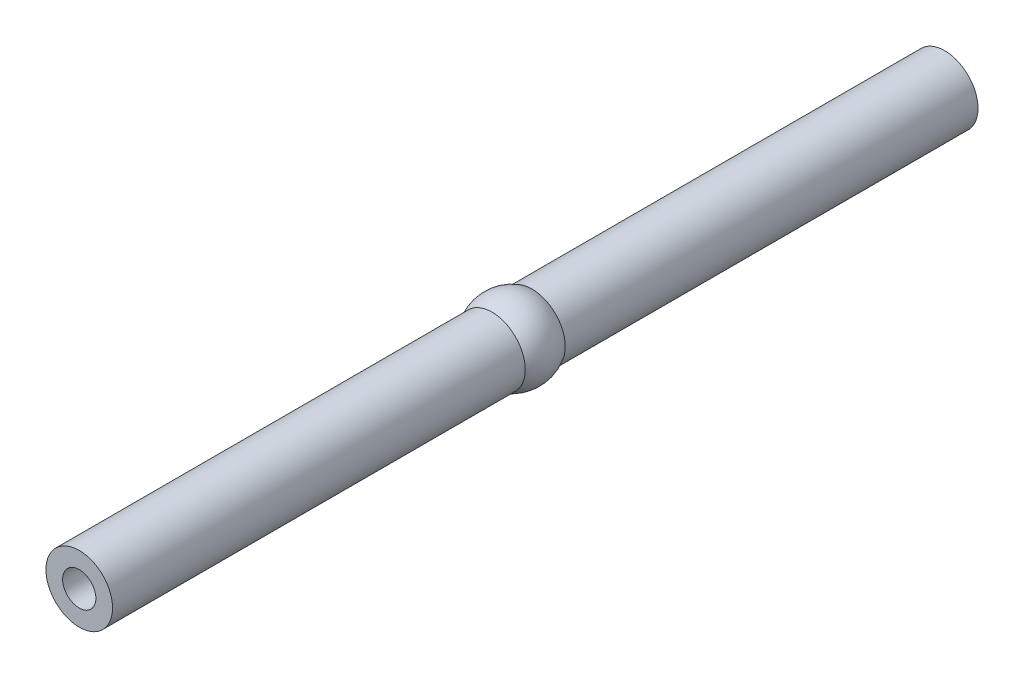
ISO-10303-21;
HEADER;
FILE_DESCRIPTION(('STEP AP214'),'2;1');
FILE_NAME('part.step','',(''),(''),'','','');
FILE_SCHEMA(('AUTOMOTIVE_DESIGN { 1 0 10303 214 1 1 1 1 }'));
ENDSEC;
DATA;
#1=APPLICATION_CONTEXT('core data for automotive mechanical design processes');
#2=APPLICATION_PROTOCOL_DEFINITION('international standard','automotive_design',2000,#1);
#3=PRODUCT_CONTEXT('',#1,'mechanical');
#4=PRODUCT('Part','Part','',(#3));
#5=PRODUCT_RELATED_PRODUCT_CATEGORY('part','',(#4));
#6=PRODUCT_DEFINITION_FORMATION('','',#4);
#7=PRODUCT_DEFINITION_CONTEXT('part definition',#1,'design');
#8=PRODUCT_DEFINITION('design','',#6,#7);
#9=PRODUCT_DEFINITION_SHAPE('','',#8);
#10=(LENGTH_UNIT() NAMED_UNIT(*) SI_UNIT(.MILLI.,.METRE.));
#11=(NAMED_UNIT(*) PLANE_ANGLE_UNIT() SI_UNIT($,.RADIAN.));
#12=(NAMED_UNIT(*) SI_UNIT($,.STERADIAN.) SOLID_ANGLE_UNIT());
#13=UNCERTAINTY_MEASURE_WITH_UNIT(LENGTH_MEASURE(1.E-05),#10,'distance_accuracy_value','');
#14=(GEOMETRIC_REPRESENTATION_CONTEXT(3) GLOBAL_UNCERTAINTY_ASSIGNED_CONTEXT((#13)) GLOBAL_UNIT_ASSIGNED_CONTEXT((#10,
#11,#12)) REPRESENTATION_CONTEXT('',''));
#15=CARTESIAN_POINT('',(0.,0.,0.));
#16=DIRECTION('',(0.,0.,1.));
#17=DIRECTION('',(1.,0.,0.));
#18=AXIS2_PLACEMENT_3D('',#15,#16,#17);
#19=CARTESIAN_POINT('',(0.,0.,39.));
#20=DIRECTION('',(0.,0.,-1.));
#21=DIRECTION('',(-1.,0.,0.));
#22=AXIS2_PLACEMENT_3D('',#19,#20,#21);
#23=CYLINDRICAL_SURFACE('',#22,3.);
#24=CARTESIAN_POINT('',(0.,0.,-39.));
#25=DIRECTION('',(0.,0.,1.));
#26=DIRECTION('',(1.,0.,0.));
#27=AXIS2_PLACEMENT_3D('',#24,#25,#26);
#28=CIRCLE('',#27,3.);
#29=CARTESIAN_POINT('',(3.,0.,-39.));
#30=VERTEX_POINT('',#29);
#31=EDGE_CURVE('E45',#30,#30,#28,.T.);
#32=ORIENTED_EDGE('',*,*,#31,.T.);
#33=EDGE_LOOP('',(#32));
#34=FACE_BOUND('',#33,.T.);
#35=CARTESIAN_POINT('',(0.,0.,-1.802775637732));
#36=DIRECTION('',(0.,0.,1.));
#37=DIRECTION('',(1.,0.,0.));
#38=AXIS2_PLACEMENT_3D('',#35,#36,#37);
#39=CIRCLE('',#38,3.);
#40=CARTESIAN_POINT('',(3.,0.,-1.802775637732));
#41=VERTEX_POINT('',#40);
#42=EDGE_CURVE('E10',#41,#41,#39,.T.);
#43=ORIENTED_EDGE('',*,*,#42,.F.);
#44=EDGE_LOOP('',(#43));
#45=FACE_BOUND('',#44,.T.);
#46=ADVANCED_FACE('F31',(#34,#45),#23,.T.);
#47=CARTESIAN_POINT('',(0.,0.,-39.));
#48=DIRECTION('',(0.,0.,1.));
#49=DIRECTION('',(1.,0.,0.));
#50=AXIS2_PLACEMENT_3D('',#47,#48,#49);
#51=PLANE('',#50);
#52=ORIENTED_EDGE('',*,*,#31,.F.);
#53=EDGE_LOOP('',(#52));
#54=FACE_BOUND('',#53,.T.);
#55=CARTESIAN_POINT('',(0.,0.,-39.));
#56=DIRECTION('',(0.,0.,1.));
#57=DIRECTION('',(1.,0.,0.));
#58=AXIS2_PLACEMENT_3D('',#55,#56,#57);
#59=CIRCLE('',#58,1.5);
#60=CARTESIAN_POINT('',(1.5,0.,-39.));
#61=VERTEX_POINT('',#60);
#62=EDGE_CURVE('E59',#61,#61,#59,.T.);
#63=ORIENTED_EDGE('',*,*,#62,.T.);
#64=EDGE_LOOP('',(#63));
#65=FACE_BOUND('',#64,.T.);
#66=ADVANCED_FACE('F63',(#54,#65),#51,.F.);
#67=CARTESIAN_POINT('',(0.,0.,-29.));
#68=DIRECTION('',(0.,0.,-1.));
#69=DIRECTION('',(-1.,0.,0.));
#70=AXIS2_PLACEMENT_3D('',#67,#68,#69);
#71=CYLINDRICAL_SURFACE('',#70,1.5);
#72=CARTESIAN_POINT('',(0.,0.,-29.));
#73=DIRECTION('',(0.,0.,1.));
#74=DIRECTION('',(1.,0.,0.));
#75=AXIS2_PLACEMENT_3D('',#72,#73,#74);
#76=CIRCLE('',#75,1.5);
#77=CARTESIAN_POINT('',(1.5,0.,-29.));
#78=VERTEX_POINT('',#77);
#79=EDGE_CURVE('E56',#78,#78,#76,.T.);
#80=ORIENTED_EDGE('',*,*,#79,.T.);
#81=EDGE_LOOP('',(#80));
#82=FACE_BOUND('',#81,.T.);
#83=ORIENTED_EDGE('',*,*,#62,.F.);
#84=EDGE_LOOP('',(#83));
#85=FACE_BOUND('',#84,.T.);
#86=ADVANCED_FACE('F65',(#82,#85),#71,.F.);
#87=CARTESIAN_POINT('',(0.,0.,-29.));
#88=DIRECTION('',(0.,0.,-1.));
#89=DIRECTION('',(1.,0.,0.));
#90=AXIS2_PLACEMENT_3D('',#87,#88,#89);
#91=PLANE('',#90);
#92=ORIENTED_EDGE('',*,*,#79,.F.);
#93=EDGE_LOOP('',(#92));
#94=FACE_BOUND('',#93,.T.);
#95=ADVANCED_FACE('F67',(#94),#91,.T.);
#96=CARTESIAN_POINT('',(0.,0.,0.));
#97=DIRECTION('',(0.,0.,-1.));
#98=DIRECTION('',(1.,0.,0.));
#99=AXIS2_PLACEMENT_3D('',#96,#97,#98);
#100=SPHERICAL_SURFACE('',#99,3.5);
#101=CARTESIAN_POINT('',(0.,0.,1.802775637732));
#102=DIRECTION('',(0.,0.,-1.));
#103=DIRECTION('',(-1.,0.,0.));
#104=AXIS2_PLACEMENT_3D('',#101,#102,#103);
#105=CIRCLE('',#104,3.);
#106=CARTESIAN_POINT('',(3.,0.,1.802775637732));
#107=VERTEX_POINT('',#106);
#108=EDGE_CURVE('E37',#107,#107,#105,.T.);
#109=CARTESIAN_POINT('',(3.,0.,1.802775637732));
#110=CARTESIAN_POINT('',(3.02032276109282,0.,1.76895705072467));
#111=CARTESIAN_POINT('',(3.0400731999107,0.,1.73479455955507));
#112=CARTESIAN_POINT('',(3.0784078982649,0.,1.66582142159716));
#113=CARTESIAN_POINT('',(3.09699215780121,0.,1.63101077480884));
#114=CARTESIAN_POINT('',(3.13297296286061,0.,1.56078097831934));
#115=CARTESIAN_POINT('',(3.1503695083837,0.,1.52536182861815));
#116=CARTESIAN_POINT('',(3.18395506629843,0.,1.45395557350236));
#117=CARTESIAN_POINT('',(3.20014407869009,0.,1.41796846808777));
#118=CARTESIAN_POINT('',(3.23129603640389,0.,1.34546744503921));
#119=CARTESIAN_POINT('',(3.24625898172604,0.,1.30895352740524));
#120=CARTESIAN_POINT('',(3.27494169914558,0.,1.2354406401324));
#121=CARTESIAN_POINT('',(3.28866147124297,0.,1.19844167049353));
#122=CARTESIAN_POINT('',(3.31484215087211,0.,1.12400099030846));
#123=CARTESIAN_POINT('',(3.32730305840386,0.,1.08655927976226));
#124=CARTESIAN_POINT('',(3.35095175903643,0.,1.01127593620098));
#125=CARTESIAN_POINT('',(3.36213955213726,0.,0.973434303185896));
#126=CARTESIAN_POINT('',(3.38322922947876,0.,0.897394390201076));
#127=CARTESIAN_POINT('',(3.39313111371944,0.,0.859196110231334));
#128=CARTESIAN_POINT('',(3.41163764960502,0.,0.782486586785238));
#129=CARTESIAN_POINT('',(3.42024230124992,0.,0.743975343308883));
#130=CARTESIAN_POINT('',(3.43614453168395,0.,0.666683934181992));
#131=CARTESIAN_POINT('',(3.44344211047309,0.,0.627903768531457));
#132=CARTESIAN_POINT('',(3.45672184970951,0.,0.550118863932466));
#133=CARTESIAN_POINT('',(3.4627040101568,0.,0.511114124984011));
#134=CARTESIAN_POINT('',(3.47334607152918,0.,0.432924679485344));
#135=CARTESIAN_POINT('',(3.47800597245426,0.,0.393739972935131));
#136=CARTESIAN_POINT('',(3.48599818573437,0.,0.315235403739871));
#137=CARTESIAN_POINT('',(3.48933049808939,0.,0.275915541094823));
#138=CARTESIAN_POINT('',(3.49466372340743,0.,0.197185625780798));
#139=CARTESIAN_POINT('',(3.49666463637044,0.,0.157775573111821));
#140=CARTESIAN_POINT('',(3.49933277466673,0.,0.078910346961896));
#141=CARTESIAN_POINT('',(3.5,0.,0.039455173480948));
#142=CARTESIAN_POINT('',(3.5,0.,-0.039455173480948));
#143=CARTESIAN_POINT('',(3.49933277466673,0.,-0.078910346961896));
#144=CARTESIAN_POINT('',(3.49666463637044,0.,-0.157775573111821));
#145=CARTESIAN_POINT('',(3.49466372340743,0.,-0.197185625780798));
#146=CARTESIAN_POINT('',(3.48933049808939,0.,-0.275915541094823));
#147=CARTESIAN_POINT('',(3.48599818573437,0.,-0.315235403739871));
#148=CARTESIAN_POINT('',(3.47800597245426,0.,-0.393739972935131));
#149=CARTESIAN_POINT('',(3.47334607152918,0.,-0.432924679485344));
#150=CARTESIAN_POINT('',(3.4627040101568,0.,-0.511114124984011));
#151=CARTESIAN_POINT('',(3.45672184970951,0.,-0.550118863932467));
#152=CARTESIAN_POINT('',(3.44344211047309,0.,-0.627903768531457));
#153=CARTESIAN_POINT('',(3.43614453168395,0.,-0.666683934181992));
#154=CARTESIAN_POINT('',(3.42024230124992,0.,-0.743975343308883));
#155=CARTESIAN_POINT('',(3.41163764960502,0.,-0.782486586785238));
#156=CARTESIAN_POINT('',(3.39313111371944,0.,-0.859196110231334));
#157=CARTESIAN_POINT('',(3.38322922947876,0.,-0.897394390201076));
#158=CARTESIAN_POINT('',(3.36213955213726,0.,-0.973434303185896));
#159=CARTESIAN_POINT('',(3.35095175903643,0.,-1.01127593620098));
#160=CARTESIAN_POINT('',(3.32730305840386,0.,-1.08655927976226));
#161=CARTESIAN_POINT('',(3.31484215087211,0.,-1.12400099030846));
#162=CARTESIAN_POINT('',(3.28866147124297,0.,-1.19844167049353));
#163=CARTESIAN_POINT('',(3.27494169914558,0.,-1.2354406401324));
#164=CARTESIAN_POINT('',(3.24625898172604,0.,-1.30895352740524));
#165=CARTESIAN_POINT('',(3.23129603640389,0.,-1.34546744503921));
#166=CARTESIAN_POINT('',(3.20014407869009,0.,-1.41796846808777));
#167=CARTESIAN_POINT('',(3.18395506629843,0.,-1.45395557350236));
#168=CARTESIAN_POINT('',(3.1503695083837,0.,-1.52536182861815));
#169=CARTESIAN_POINT('',(3.13297296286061,0.,-1.56078097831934));
#170=CARTESIAN_POINT('',(3.09699215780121,0.,-1.63101077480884));
#171=CARTESIAN_POINT('',(3.0784078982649,0.,-1.66582142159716));
#172=CARTESIAN_POINT('',(3.0400731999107,0.,-1.73479455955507));
#173=CARTESIAN_POINT('',(3.02032276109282,0.,-1.76895705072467));
#174=CARTESIAN_POINT('',(3.,0.,-1.802775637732));
#175=B_SPLINE_CURVE_WITH_KNOTS('',3,(#109,#110,#111,#112,#113,#114,#115,#116,#117,#118,#119,
#120,#121,#122,#123,#124,#125,#126,#127,#128,#129,#130,#131,#132,#133,#134,#135,#136,#137,#138,
#139,#140,#141,#142,#143,#144,#145,#146,#147,#148,#149,#150,#151,#152,#153,#154,#155,#156,#157,
#158,#159,#160,#161,#162,#163,#164,#165,#166,#167,#168,#169,#170,#171,#172,#173,#174),
.UNSPECIFIED.,.F.,.F.,(4,2,2,2,2,2,2,2,2,2,2,2,2,2,2,2,2,2,2,2,2,2,2,2,2,2,2,2,2,2,2,2,4),(0.,
0.118359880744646,0.236719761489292,0.355079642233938,0.473439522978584,0.59179940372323,
0.710159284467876,0.828519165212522,0.946879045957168,1.06523892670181,1.18359880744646,
1.30195868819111,1.42031856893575,1.5386784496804,1.65703833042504,1.77539821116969,
1.89375809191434,2.01211797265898,2.13047785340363,2.24883773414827,2.36719761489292,
2.48555749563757,2.60391737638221,2.72227725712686,2.8406371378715,2.95899701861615,
3.0773568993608,3.19571678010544,3.31407666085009,3.43243654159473,3.55079642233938,
3.66915630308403,3.78751618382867),.UNSPECIFIED.);
#176=EDGE_CURVE('BSEAM74',#107,#41,#175,.T.);
#177=ORIENTED_EDGE('',*,*,#108,.T.);
#178=ORIENTED_EDGE('',*,*,#42,.T.);
#179=ORIENTED_EDGE('',*,*,#176,.T.);
#180=ORIENTED_EDGE('',*,*,#176,.F.);
#181=EDGE_LOOP('',(#177,#179,#178,#180));
#182=FACE_BOUND('',#181,.T.);
#183=ADVANCED_FACE('F74',(#182),#100,.T.);
#184=CARTESIAN_POINT('',(0.,0.,29.));
#185=DIRECTION('',(0.,0.,1.));
#186=DIRECTION('',(1.,0.,0.));
#187=AXIS2_PLACEMENT_3D('',#184,#185,#186);
#188=PLANE('',#187);
#189=CARTESIAN_POINT('',(0.,0.,29.));
#190=DIRECTION('',(0.,0.,1.));
#191=DIRECTION('',(1.,0.,0.));
#192=AXIS2_PLACEMENT_3D('',#189,#190,#191);
#193=CIRCLE('',#192,1.5);
#194=CARTESIAN_POINT('',(1.5,0.,29.));
#195=VERTEX_POINT('',#194);
#196=EDGE_CURVE('E50',#195,#195,#193,.T.);
#197=ORIENTED_EDGE('',*,*,#196,.T.);
#198=EDGE_LOOP('',(#197));
#199=FACE_BOUND('',#198,.T.);
#200=ADVANCED_FACE('F100',(#199),#188,.T.);
#201=CARTESIAN_POINT('',(0.,0.,29.));
#202=DIRECTION('',(0.,0.,1.));
#203=DIRECTION('',(1.,0.,0.));
#204=AXIS2_PLACEMENT_3D('',#201,#202,#203);
#205=CYLINDRICAL_SURFACE('',#204,1.5);
#206=ORIENTED_EDGE('',*,*,#196,.F.);
#207=EDGE_LOOP('',(#206));
#208=FACE_BOUND('',#207,.T.);
#209=CARTESIAN_POINT('',(0.,0.,39.));
#210=DIRECTION('',(0.,0.,1.));
#211=DIRECTION('',(1.,0.,0.));
#212=AXIS2_PLACEMENT_3D('',#209,#210,#211);
#213=CIRCLE('',#212,1.5);
#214=CARTESIAN_POINT('',(1.5,0.,39.));
#215=VERTEX_POINT('',#214);
#216=EDGE_CURVE('E53',#215,#215,#213,.T.);
#217=ORIENTED_EDGE('',*,*,#216,.T.);
#218=EDGE_LOOP('',(#217));
#219=FACE_BOUND('',#218,.T.);
#220=ADVANCED_FACE('F92',(#208,#219),#205,.F.);
#221=CARTESIAN_POINT('',(0.,0.,39.));
#222=DIRECTION('',(0.,0.,1.));
#223=DIRECTION('',(1.,0.,0.));
#224=AXIS2_PLACEMENT_3D('',#221,#222,#223);
#225=PLANE('',#224);
#226=ORIENTED_EDGE('',*,*,#216,.F.);
#227=EDGE_LOOP('',(#226));
#228=FACE_BOUND('',#227,.T.);
#229=CARTESIAN_POINT('',(0.,0.,39.));
#230=DIRECTION('',(0.,0.,1.));
#231=DIRECTION('',(1.,0.,0.));
#232=AXIS2_PLACEMENT_3D('',#229,#230,#231);
#233=CIRCLE('',#232,3.);
#234=CARTESIAN_POINT('',(3.,0.,39.));
#235=VERTEX_POINT('',#234);
#236=EDGE_CURVE('E41',#235,#235,#233,.T.);
#237=ORIENTED_EDGE('',*,*,#236,.T.);
#238=EDGE_LOOP('',(#237));
#239=FACE_BOUND('',#238,.T.);
#240=ADVANCED_FACE('F87',(#228,#239),#225,.T.);
#241=ORIENTED_EDGE('',*,*,#236,.F.);
#242=EDGE_LOOP('',(#241));
#243=FACE_BOUND('',#242,.T.);
#244=ORIENTED_EDGE('',*,*,#108,.F.);
#245=EDGE_LOOP('',(#244));
#246=FACE_BOUND('',#245,.T.);
#247=ADVANCED_FACE('F82',(#243,#246),#23,.T.);
#248=CLOSED_SHELL('',(#46,#66,#86,#95,#183,#200,#220,#240,#247));
#249=MANIFOLD_SOLID_BREP('B2',#248);
#250=ADVANCED_BREP_SHAPE_REPRESENTATION('',(#18,#249),#14);
#251=SHAPE_DEFINITION_REPRESENTATION(#9,#250);
ENDSEC;
END-ISO-10303-21;
